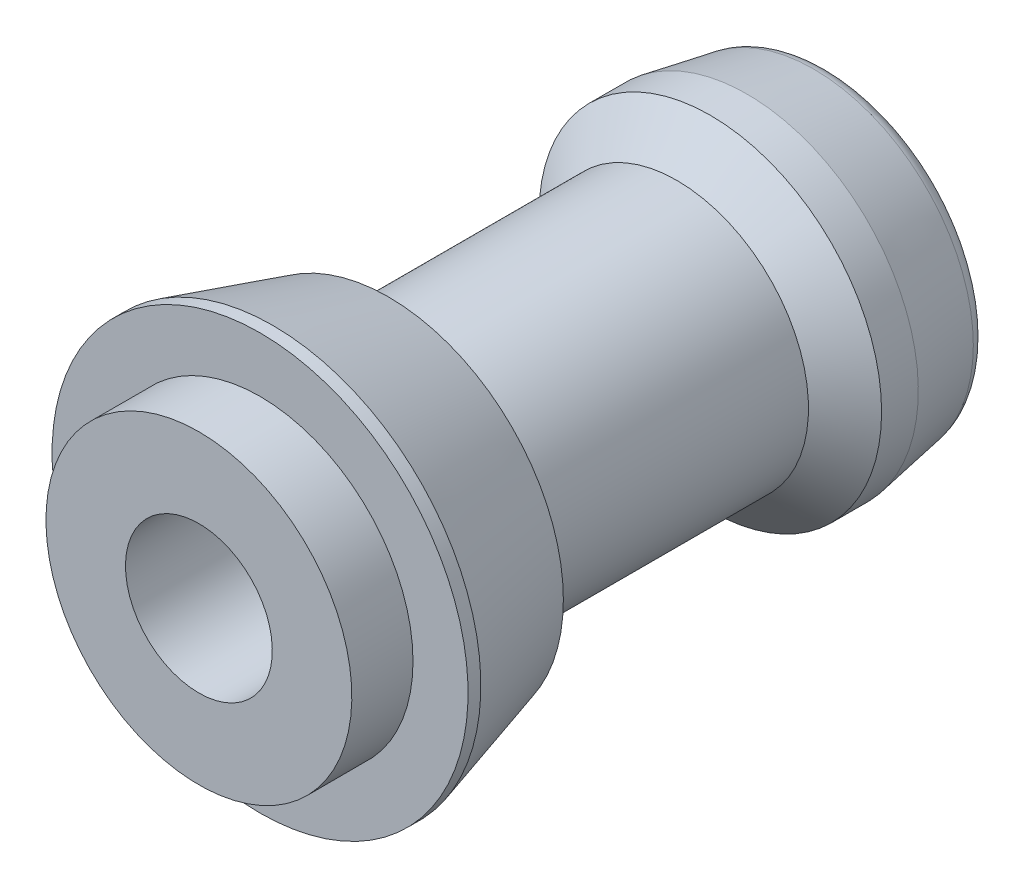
ISO-10303-21;
HEADER;
FILE_DESCRIPTION(('STEP AP214'),'2;1');
FILE_NAME('part.step','',(''),(''),'','','');
FILE_SCHEMA(('AUTOMOTIVE_DESIGN { 1 0 10303 214 1 1 1 1 }'));
ENDSEC;
DATA;
#1=APPLICATION_CONTEXT('core data for automotive mechanical design processes');
#2=APPLICATION_PROTOCOL_DEFINITION('international standard','automotive_design',2000,#1);
#3=PRODUCT_CONTEXT('',#1,'mechanical');
#4=PRODUCT('Part','Part','',(#3));
#5=PRODUCT_RELATED_PRODUCT_CATEGORY('part','',(#4));
#6=PRODUCT_DEFINITION_FORMATION('','',#4);
#7=PRODUCT_DEFINITION_CONTEXT('part definition',#1,'design');
#8=PRODUCT_DEFINITION('design','',#6,#7);
#9=PRODUCT_DEFINITION_SHAPE('','',#8);
#10=(LENGTH_UNIT() NAMED_UNIT(*) SI_UNIT(.MILLI.,.METRE.));
#11=(NAMED_UNIT(*) PLANE_ANGLE_UNIT() SI_UNIT($,.RADIAN.));
#12=(NAMED_UNIT(*) SI_UNIT($,.STERADIAN.) SOLID_ANGLE_UNIT());
#13=UNCERTAINTY_MEASURE_WITH_UNIT(LENGTH_MEASURE(1.E-05),#10,'distance_accuracy_value','');
#14=(GEOMETRIC_REPRESENTATION_CONTEXT(3) GLOBAL_UNCERTAINTY_ASSIGNED_CONTEXT((#13)) GLOBAL_UNIT_ASSIGNED_CONTEXT((#10,
#11,#12)) REPRESENTATION_CONTEXT('',''));
#15=CARTESIAN_POINT('',(0.,0.,0.));
#16=DIRECTION('',(0.,0.,1.));
#17=DIRECTION('',(1.,0.,0.));
#18=AXIS2_PLACEMENT_3D('',#15,#16,#17);
#19=CARTESIAN_POINT('',(0.,0.,5.));
#20=DIRECTION('',(0.,0.,1.));
#21=DIRECTION('',(0.,-1.,0.));
#22=AXIS2_PLACEMENT_3D('',#19,#20,#21);
#23=CYLINDRICAL_SURFACE('',#22,4.924473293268);
#24=CARTESIAN_POINT('',(0.,0.,-19.));
#25=DIRECTION('',(0.,0.,1.));
#26=DIRECTION('',(0.,-1.,0.));
#27=AXIS2_PLACEMENT_3D('',#24,#25,#26);
#28=CIRCLE('',#27,4.924473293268);
#29=CARTESIAN_POINT('',(0.,-4.92447329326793,-19.));
#30=VERTEX_POINT('',#29);
#31=EDGE_CURVE('E139',#30,#30,#28,.T.);
#32=ORIENTED_EDGE('',*,*,#31,.T.);
#33=EDGE_LOOP('',(#32));
#34=FACE_BOUND('',#33,.T.);
#35=CARTESIAN_POINT('',(0.,1.15218884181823E-13,-33.));
#36=DIRECTION('',(0.,0.,-1.));
#37=DIRECTION('',(0.,1.,0.));
#38=AXIS2_PLACEMENT_3D('',#35,#36,#37);
#39=CIRCLE('',#38,4.924473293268);
#40=CARTESIAN_POINT('',(0.,4.92447329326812,-33.));
#41=VERTEX_POINT('',#40);
#42=EDGE_CURVE('E121',#41,#41,#39,.F.);
#43=ORIENTED_EDGE('',*,*,#42,.F.);
#44=EDGE_LOOP('',(#43));
#45=FACE_BOUND('',#44,.T.);
#46=ADVANCED_FACE('F16',(#34,#45),#23,.F.);
#47=CARTESIAN_POINT('',(0.,0.,0.));
#48=DIRECTION('',(0.,0.,1.));
#49=DIRECTION('',(0.,-1.,0.));
#50=AXIS2_PLACEMENT_3D('',#47,#48,#49);
#51=PLANE('',#50);
#52=CARTESIAN_POINT('',(0.,0.,0.));
#53=DIRECTION('',(0.,0.,1.));
#54=DIRECTION('',(0.,-1.,0.));
#55=AXIS2_PLACEMENT_3D('',#52,#53,#54);
#56=CIRCLE('',#55,12.5);
#57=CARTESIAN_POINT('',(0.,-12.5,0.));
#58=VERTEX_POINT('',#57);
#59=EDGE_CURVE('E158',#58,#58,#56,.T.);
#60=ORIENTED_EDGE('',*,*,#59,.F.);
#61=EDGE_LOOP('',(#60));
#62=FACE_BOUND('',#61,.T.);
#63=CARTESIAN_POINT('',(0.,0.,0.));
#64=DIRECTION('',(0.,0.,-1.));
#65=DIRECTION('',(0.,1.,0.));
#66=AXIS2_PLACEMENT_3D('',#63,#64,#65);
#67=CIRCLE('',#66,17.);
#68=CARTESIAN_POINT('',(0.,17.,0.));
#69=VERTEX_POINT('',#68);
#70=EDGE_CURVE('E154',#69,#69,#67,.T.);
#71=ORIENTED_EDGE('',*,*,#70,.F.);
#72=EDGE_LOOP('',(#71));
#73=FACE_BOUND('',#72,.T.);
#74=ADVANCED_FACE('F190',(#62,#73),#51,.T.);
#75=CARTESIAN_POINT('',(0.,0.,0.));
#76=DIRECTION('',(0.,0.,-1.));
#77=DIRECTION('',(0.,1.,0.));
#78=AXIS2_PLACEMENT_3D('',#75,#76,#77);
#79=CYLINDRICAL_SURFACE('',#78,17.);
#80=ORIENTED_EDGE('',*,*,#70,.T.);
#81=EDGE_LOOP('',(#80));
#82=FACE_BOUND('',#81,.T.);
#83=CARTESIAN_POINT('',(0.,0.,-1.04622433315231));
#84=DIRECTION('',(0.,0.,-1.));
#85=DIRECTION('',(0.,1.,0.));
#86=AXIS2_PLACEMENT_3D('',#83,#84,#85);
#87=CIRCLE('',#86,17.);
#88=CARTESIAN_POINT('',(0.,17.,-1.04622433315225));
#89=VERTEX_POINT('',#88);
#90=EDGE_CURVE('E151',#89,#89,#87,.T.);
#91=ORIENTED_EDGE('',*,*,#90,.F.);
#92=EDGE_LOOP('',(#91));
#93=FACE_BOUND('',#92,.T.);
#94=ADVANCED_FACE('F197',(#82,#93),#79,.T.);
#95=CARTESIAN_POINT('',(0.,0.,-10.5));
#96=DIRECTION('',(0.,0.,1.));
#97=DIRECTION('',(0.,-1.,0.));
#98=AXIS2_PLACEMENT_3D('',#95,#96,#97);
#99=CONICAL_SURFACE('',#98,14.2891734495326,0.279252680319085);
#100=ORIENTED_EDGE('',*,*,#90,.T.);
#101=EDGE_LOOP('',(#100));
#102=FACE_BOUND('',#101,.T.);
#103=CARTESIAN_POINT('',(0.,0.,-10.5));
#104=DIRECTION('',(0.,0.,-1.));
#105=DIRECTION('',(0.,1.,0.));
#106=AXIS2_PLACEMENT_3D('',#103,#104,#105);
#107=CIRCLE('',#106,14.2891734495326);
#108=CARTESIAN_POINT('',(0.,14.2891734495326,-10.5));
#109=VERTEX_POINT('',#108);
#110=EDGE_CURVE('E148',#109,#109,#107,.T.);
#111=ORIENTED_EDGE('',*,*,#110,.F.);
#112=EDGE_LOOP('',(#111));
#113=FACE_BOUND('',#112,.T.);
#114=ADVANCED_FACE('F257',(#102,#113),#99,.T.);
#115=CARTESIAN_POINT('',(0.,0.,-12.5433427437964));
#116=DIRECTION('',(0.,0.,1.));
#117=DIRECTION('',(0.,-1.,0.));
#118=AXIS2_PLACEMENT_3D('',#115,#116,#117);
#119=CONICAL_SURFACE('',#118,10.75,1.0471975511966);
#120=CARTESIAN_POINT('',(0.,0.,-12.5433427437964));
#121=DIRECTION('',(0.,0.,1.));
#122=DIRECTION('',(0.,-1.,0.));
#123=AXIS2_PLACEMENT_3D('',#120,#121,#122);
#124=CIRCLE('',#123,10.75);
#125=CARTESIAN_POINT('',(0.,-10.75,-12.5433427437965));
#126=VERTEX_POINT('',#125);
#127=EDGE_CURVE('E20',#126,#126,#124,.T.);
#128=ORIENTED_EDGE('',*,*,#127,.T.);
#129=EDGE_LOOP('',(#128));
#130=FACE_BOUND('',#129,.T.);
#131=ORIENTED_EDGE('',*,*,#110,.T.);
#132=EDGE_LOOP('',(#131));
#133=FACE_BOUND('',#132,.T.);
#134=ADVANCED_FACE('F186',(#130,#133),#119,.T.);
#135=CARTESIAN_POINT('',(0.,0.,0.));
#136=DIRECTION('',(0.,0.,1.));
#137=DIRECTION('',(0.,-1.,0.));
#138=AXIS2_PLACEMENT_3D('',#135,#136,#137);
#139=CYLINDRICAL_SURFACE('',#138,10.75);
#140=ORIENTED_EDGE('',*,*,#127,.F.);
#141=EDGE_LOOP('',(#140));
#142=FACE_BOUND('',#141,.T.);
#143=CARTESIAN_POINT('',(0.,1.18964985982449E-13,-34.0729261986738));
#144=DIRECTION('',(0.,0.,-1.));
#145=DIRECTION('',(0.,1.,0.));
#146=AXIS2_PLACEMENT_3D('',#143,#144,#145);
#147=CIRCLE('',#146,10.75);
#148=CARTESIAN_POINT('',(0.,10.7500000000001,-34.0729261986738));
#149=VERTEX_POINT('',#148);
#150=EDGE_CURVE('E157',#149,#149,#147,.F.);
#151=ORIENTED_EDGE('',*,*,#150,.T.);
#152=EDGE_LOOP('',(#151));
#153=FACE_BOUND('',#152,.T.);
#154=ADVANCED_FACE('F170',(#142,#153),#139,.T.);
#155=CARTESIAN_POINT('',(0.,1.28486513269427E-13,-36.8));
#156=DIRECTION('',(0.,0.,-1.));
#157=DIRECTION('',(0.,1.,0.));
#158=AXIS2_PLACEMENT_3D('',#155,#156,#157);
#159=CONICAL_SURFACE('',#158,14.,0.872664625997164);
#160=CARTESIAN_POINT('',(0.,1.28486513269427E-13,-36.8));
#161=DIRECTION('',(0.,0.,-1.));
#162=DIRECTION('',(0.,1.,0.));
#163=AXIS2_PLACEMENT_3D('',#160,#161,#162);
#164=CIRCLE('',#163,14.);
#165=CARTESIAN_POINT('',(0.,14.0000000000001,-36.7999999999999));
#166=VERTEX_POINT('',#165);
#167=EDGE_CURVE('E165',#166,#166,#164,.F.);
#168=ORIENTED_EDGE('',*,*,#167,.T.);
#169=EDGE_LOOP('',(#168));
#170=FACE_BOUND('',#169,.T.);
#171=ORIENTED_EDGE('',*,*,#150,.F.);
#172=EDGE_LOOP('',(#171));
#173=FACE_BOUND('',#172,.T.);
#174=ADVANCED_FACE('F172',(#170,#173),#159,.T.);
#175=CARTESIAN_POINT('',(0.,0.,0.));
#176=DIRECTION('',(0.,0.,1.));
#177=DIRECTION('',(0.,-1.,0.));
#178=AXIS2_PLACEMENT_3D('',#175,#176,#177);
#179=CYLINDRICAL_SURFACE('',#178,14.);
#180=ORIENTED_EDGE('',*,*,#167,.F.);
#181=EDGE_LOOP('',(#180));
#182=FACE_BOUND('',#181,.T.);
#183=CARTESIAN_POINT('',(0.,1.38960957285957E-13,-39.8));
#184=DIRECTION('',(0.,0.,1.));
#185=DIRECTION('',(0.,-1.,0.));
#186=AXIS2_PLACEMENT_3D('',#183,#184,#185);
#187=CIRCLE('',#186,14.);
#188=CARTESIAN_POINT('',(0.,-13.9999999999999,-39.8000000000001));
#189=VERTEX_POINT('',#188);
#190=EDGE_CURVE('E145',#189,#189,#187,.T.);
#191=ORIENTED_EDGE('',*,*,#190,.T.);
#192=EDGE_LOOP('',(#191));
#193=FACE_BOUND('',#192,.T.);
#194=ADVANCED_FACE('F174',(#182,#193),#179,.T.);
#195=CARTESIAN_POINT('',(0.,1.62353882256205E-13,-46.5));
#196=DIRECTION('',(0.,0.,1.));
#197=DIRECTION('',(0.,-1.,0.));
#198=AXIS2_PLACEMENT_3D('',#195,#196,#197);
#199=CONICAL_SURFACE('',#198,12.8186092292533,0.174532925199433);
#200=CARTESIAN_POINT('',(0.,1.58026094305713E-13,-45.2604722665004));
#201=DIRECTION('',(0.,0.,-1.));
#202=DIRECTION('',(0.,1.,0.));
#203=AXIS2_PLACEMENT_3D('',#200,#201,#202);
#204=CIRCLE('',#203,13.0371714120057);
#205=CARTESIAN_POINT('',(0.,13.0371714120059,-45.2604722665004));
#206=VERTEX_POINT('',#205);
#207=EDGE_CURVE('E25',#206,#206,#204,.F.);
#208=ORIENTED_EDGE('',*,*,#207,.T.);
#209=EDGE_LOOP('',(#208));
#210=FACE_BOUND('',#209,.T.);
#211=ORIENTED_EDGE('',*,*,#190,.F.);
#212=EDGE_LOOP('',(#211));
#213=FACE_BOUND('',#212,.T.);
#214=ADVANCED_FACE('F183',(#210,#213),#199,.T.);
#215=CARTESIAN_POINT('',(12.8186092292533,1.62353882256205E-13,-46.5));
#216=DIRECTION('',(0.,0.,1.));
#217=DIRECTION('',(0.,-1.,0.));
#218=AXIS2_PLACEMENT_3D('',#215,#216,#217);
#219=PLANE('',#218);
#220=CARTESIAN_POINT('',(0.,1.62353882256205E-13,-46.5));
#221=DIRECTION('',(0.,0.,1.));
#222=DIRECTION('',(0.,-1.,0.));
#223=AXIS2_PLACEMENT_3D('',#220,#221,#222);
#224=CIRCLE('',#223,8.25);
#225=CARTESIAN_POINT('',(0.,-8.24999999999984,-46.5));
#226=VERTEX_POINT('',#225);
#227=EDGE_CURVE('E127',#226,#226,#224,.T.);
#228=ORIENTED_EDGE('',*,*,#227,.T.);
#229=EDGE_LOOP('',(#228));
#230=FACE_BOUND('',#229,.T.);
#231=CARTESIAN_POINT('',(0.,1.62353882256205E-13,-46.5));
#232=DIRECTION('',(0.,0.,1.));
#233=DIRECTION('',(0.,-1.,0.));
#234=AXIS2_PLACEMENT_3D('',#231,#232,#233);
#235=CIRCLE('',#234,11.5599597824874);
#236=CARTESIAN_POINT('',(0.,-11.5599597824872,-46.5));
#237=VERTEX_POINT('',#236);
#238=EDGE_CURVE('E10',#237,#237,#235,.F.);
#239=ORIENTED_EDGE('',*,*,#238,.T.);
#240=EDGE_LOOP('',(#239));
#241=FACE_BOUND('',#240,.T.);
#242=ADVANCED_FACE('F211',(#230,#241),#219,.F.);
#243=CARTESIAN_POINT('',(0.,0.,5.));
#244=DIRECTION('',(0.,0.,1.));
#245=DIRECTION('',(0.,-1.,0.));
#246=AXIS2_PLACEMENT_3D('',#243,#244,#245);
#247=PLANE('',#246);
#248=CARTESIAN_POINT('',(0.,0.,5.));
#249=DIRECTION('',(0.,0.,1.));
#250=DIRECTION('',(0.,-1.,0.));
#251=AXIS2_PLACEMENT_3D('',#248,#249,#250);
#252=CIRCLE('',#251,6.);
#253=CARTESIAN_POINT('',(0.,-6.00000000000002,4.99999999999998));
#254=VERTEX_POINT('',#253);
#255=EDGE_CURVE('E133',#254,#254,#252,.T.);
#256=ORIENTED_EDGE('',*,*,#255,.F.);
#257=EDGE_LOOP('',(#256));
#258=FACE_BOUND('',#257,.T.);
#259=CARTESIAN_POINT('',(0.,0.,5.));
#260=DIRECTION('',(0.,0.,-1.));
#261=DIRECTION('',(0.,1.,0.));
#262=AXIS2_PLACEMENT_3D('',#259,#260,#261);
#263=CIRCLE('',#262,12.5);
#264=CARTESIAN_POINT('',(0.,12.5,5.00000000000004));
#265=VERTEX_POINT('',#264);
#266=EDGE_CURVE('E142',#265,#265,#263,.T.);
#267=ORIENTED_EDGE('',*,*,#266,.F.);
#268=EDGE_LOOP('',(#267));
#269=FACE_BOUND('',#268,.T.);
#270=ADVANCED_FACE('F207',(#258,#269),#247,.T.);
#271=CARTESIAN_POINT('',(0.,0.,0.));
#272=DIRECTION('',(0.,0.,-1.));
#273=DIRECTION('',(0.,1.,0.));
#274=AXIS2_PLACEMENT_3D('',#271,#272,#273);
#275=CYLINDRICAL_SURFACE('',#274,12.5);
#276=ORIENTED_EDGE('',*,*,#266,.T.);
#277=EDGE_LOOP('',(#276));
#278=FACE_BOUND('',#277,.T.);
#279=ORIENTED_EDGE('',*,*,#59,.T.);
#280=EDGE_LOOP('',(#279));
#281=FACE_BOUND('',#280,.T.);
#282=ADVANCED_FACE('F204',(#278,#281),#275,.T.);
#283=CARTESIAN_POINT('',(0.,1.57116660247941E-13,-45.));
#284=DIRECTION('',(0.,0.,1.));
#285=DIRECTION('',(0.,-1.,0.));
#286=AXIS2_PLACEMENT_3D('',#283,#284,#285);
#287=TOROIDAL_SURFACE('',#286,11.5599597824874,1.5);
#288=ORIENTED_EDGE('',*,*,#238,.F.);
#289=EDGE_LOOP('',(#288));
#290=FACE_BOUND('',#289,.T.);
#291=ORIENTED_EDGE('',*,*,#207,.F.);
#292=EDGE_LOOP('',(#291));
#293=FACE_BOUND('',#292,.T.);
#294=ADVANCED_FACE('F18',(#290,#293),#287,.T.);
#295=CARTESIAN_POINT('',(6.,0.,-19.));
#296=DIRECTION('',(0.,0.,-1.));
#297=DIRECTION('',(0.,1.,0.));
#298=AXIS2_PLACEMENT_3D('',#295,#296,#297);
#299=PLANE('',#298);
#300=ORIENTED_EDGE('',*,*,#31,.F.);
#301=EDGE_LOOP('',(#300));
#302=FACE_BOUND('',#301,.T.);
#303=CARTESIAN_POINT('',(0.,0.,-19.));
#304=DIRECTION('',(0.,0.,1.));
#305=DIRECTION('',(0.,-1.,0.));
#306=AXIS2_PLACEMENT_3D('',#303,#304,#305);
#307=CIRCLE('',#306,6.);
#308=CARTESIAN_POINT('',(0.,-5.99999999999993,-19.));
#309=VERTEX_POINT('',#308);
#310=EDGE_CURVE('E136',#309,#309,#307,.T.);
#311=ORIENTED_EDGE('',*,*,#310,.T.);
#312=EDGE_LOOP('',(#311));
#313=FACE_BOUND('',#312,.T.);
#314=ADVANCED_FACE('F202',(#302,#313),#299,.F.);
#315=CARTESIAN_POINT('',(0.,0.,5.));
#316=DIRECTION('',(0.,0.,1.));
#317=DIRECTION('',(0.,-1.,0.));
#318=AXIS2_PLACEMENT_3D('',#315,#316,#317);
#319=CYLINDRICAL_SURFACE('',#318,6.);
#320=ORIENTED_EDGE('',*,*,#310,.F.);
#321=EDGE_LOOP('',(#320));
#322=FACE_BOUND('',#321,.T.);
#323=ORIENTED_EDGE('',*,*,#255,.T.);
#324=EDGE_LOOP('',(#323));
#325=FACE_BOUND('',#324,.T.);
#326=ADVANCED_FACE('F232',(#322,#325),#319,.F.);
#327=CARTESIAN_POINT('',(8.25,1.39659253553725E-13,-40.));
#328=DIRECTION('',(0.,0.,-1.));
#329=DIRECTION('',(0.,1.,0.));
#330=AXIS2_PLACEMENT_3D('',#327,#328,#329);
#331=PLANE('',#330);
#332=DIRECTION('',(0.5,-0.866025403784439,0.));
#333=VECTOR('',#332,1.);
#334=CARTESIAN_POINT('',(2.88675134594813,5.00000000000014,-40.));
#335=LINE('',#334,#333);
#336=CARTESIAN_POINT('',(2.88675134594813,5.00000000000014,-40.));
#337=VERTEX_POINT('',#336);
#338=CARTESIAN_POINT('',(5.77350269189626,1.42478179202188E-13,-40.));
#339=VERTEX_POINT('',#338);
#340=EDGE_CURVE('E33',#337,#339,#335,.T.);
#341=ORIENTED_EDGE('',*,*,#340,.F.);
#342=DIRECTION('',(1.,0.,0.));
#343=VECTOR('',#342,1.);
#344=CARTESIAN_POINT('',(-2.88675134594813,5.00000000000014,-40.));
#345=LINE('',#344,#343);
#346=CARTESIAN_POINT('',(-2.88675134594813,5.00000000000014,-40.));
#347=VERTEX_POINT('',#346);
#348=EDGE_CURVE('E117',#347,#337,#345,.T.);
#349=ORIENTED_EDGE('',*,*,#348,.F.);
#350=DIRECTION('',(0.5,0.866025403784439,0.));
#351=VECTOR('',#350,1.);
#352=CARTESIAN_POINT('',(-5.77350269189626,1.38805213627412E-13,-40.));
#353=LINE('',#352,#351);
#354=CARTESIAN_POINT('',(-5.77350269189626,1.38805213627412E-13,-40.));
#355=VERTEX_POINT('',#354);
#356=EDGE_CURVE('E115',#355,#347,#353,.T.);
#357=ORIENTED_EDGE('',*,*,#356,.F.);
#358=DIRECTION('',(-0.5,0.866025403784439,0.));
#359=VECTOR('',#358,1.);
#360=CARTESIAN_POINT('',(-2.88675134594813,-4.99999999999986,-40.));
#361=LINE('',#360,#359);
#362=CARTESIAN_POINT('',(-2.88675134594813,-4.99999999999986,-40.));
#363=VERTEX_POINT('',#362);
#364=EDGE_CURVE('E81',#363,#355,#361,.T.);
#365=ORIENTED_EDGE('',*,*,#364,.F.);
#366=DIRECTION('',(-1.,0.,0.));
#367=VECTOR('',#366,1.);
#368=CARTESIAN_POINT('',(2.88675134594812,-4.99999999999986,-40.));
#369=LINE('',#368,#367);
#370=CARTESIAN_POINT('',(2.88675134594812,-4.99999999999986,-40.));
#371=VERTEX_POINT('',#370);
#372=EDGE_CURVE('E111',#371,#363,#369,.T.);
#373=ORIENTED_EDGE('',*,*,#372,.F.);
#374=DIRECTION('',(-0.5,-0.866025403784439,0.));
#375=VECTOR('',#374,1.);
#376=CARTESIAN_POINT('',(5.77350269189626,1.42356811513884E-13,-40.));
#377=LINE('',#376,#375);
#378=EDGE_CURVE('E108',#339,#371,#377,.T.);
#379=ORIENTED_EDGE('',*,*,#378,.F.);
#380=EDGE_LOOP('',(#341,#349,#357,#365,#373,#379));
#381=FACE_BOUND('',#380,.T.);
#382=CARTESIAN_POINT('',(0.,1.39659253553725E-13,-40.));
#383=DIRECTION('',(0.,0.,1.));
#384=DIRECTION('',(0.,-1.,0.));
#385=AXIS2_PLACEMENT_3D('',#382,#383,#384);
#386=CIRCLE('',#385,8.25);
#387=CARTESIAN_POINT('',(0.,-8.24999999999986,-40.));
#388=VERTEX_POINT('',#387);
#389=EDGE_CURVE('E130',#388,#388,#386,.T.);
#390=ORIENTED_EDGE('',*,*,#389,.F.);
#391=EDGE_LOOP('',(#390));
#392=FACE_BOUND('',#391,.T.);
#393=ADVANCED_FACE('F241',(#381,#392),#331,.T.);
#394=CARTESIAN_POINT('',(0.,0.,0.));
#395=DIRECTION('',(0.,0.,1.));
#396=DIRECTION('',(0.,-1.,0.));
#397=AXIS2_PLACEMENT_3D('',#394,#395,#396);
#398=CYLINDRICAL_SURFACE('',#397,8.25);
#399=ORIENTED_EDGE('',*,*,#389,.T.);
#400=EDGE_LOOP('',(#399));
#401=FACE_BOUND('',#400,.T.);
#402=ORIENTED_EDGE('',*,*,#227,.F.);
#403=EDGE_LOOP('',(#402));
#404=FACE_BOUND('',#403,.T.);
#405=ADVANCED_FACE('F357',(#401,#404),#398,.F.);
#406=CARTESIAN_POINT('',(0.,1.15218884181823E-13,-33.));
#407=DIRECTION('',(0.,0.,-1.));
#408=DIRECTION('',(0.,1.,0.));
#409=AXIS2_PLACEMENT_3D('',#406,#407,#408);
#410=PLANE('',#409);
#411=DIRECTION('',(0.5,-0.866025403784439,0.));
#412=VECTOR('',#411,1.);
#413=CARTESIAN_POINT('',(2.88675134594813,5.00000000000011,-33.));
#414=LINE('',#413,#412);
#415=CARTESIAN_POINT('',(2.88675134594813,5.00000000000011,-33.));
#416=VERTEX_POINT('',#415);
#417=CARTESIAN_POINT('',(5.77350269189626,1.17916442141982E-13,-33.));
#418=VERTEX_POINT('',#417);
#419=EDGE_CURVE('E119',#416,#418,#414,.T.);
#420=ORIENTED_EDGE('',*,*,#419,.T.);
#421=DIRECTION('',(-0.5,-0.866025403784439,0.));
#422=VECTOR('',#421,1.);
#423=CARTESIAN_POINT('',(5.77350269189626,1.17916442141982E-13,-33.));
#424=LINE('',#423,#422);
#425=CARTESIAN_POINT('',(2.88675134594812,-4.99999999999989,-33.));
#426=VERTEX_POINT('',#425);
#427=EDGE_CURVE('E102',#418,#426,#424,.T.);
#428=ORIENTED_EDGE('',*,*,#427,.T.);
#429=DIRECTION('',(-1.,0.,0.));
#430=VECTOR('',#429,1.);
#431=CARTESIAN_POINT('',(2.88675134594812,-4.99999999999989,-33.));
#432=LINE('',#431,#430);
#433=CARTESIAN_POINT('',(-2.88675134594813,-4.99999999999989,-33.));
#434=VERTEX_POINT('',#433);
#435=EDGE_CURVE('E100',#426,#434,#432,.T.);
#436=ORIENTED_EDGE('',*,*,#435,.T.);
#437=DIRECTION('',(-0.5,0.866025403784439,0.));
#438=VECTOR('',#437,1.);
#439=CARTESIAN_POINT('',(-2.88675134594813,-4.99999999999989,-33.));
#440=LINE('',#439,#438);
#441=CARTESIAN_POINT('',(-5.77350269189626,1.1436484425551E-13,-33.));
#442=VERTEX_POINT('',#441);
#443=EDGE_CURVE('E78',#434,#442,#440,.T.);
#444=ORIENTED_EDGE('',*,*,#443,.T.);
#445=DIRECTION('',(0.5,0.866025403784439,0.));
#446=VECTOR('',#445,1.);
#447=CARTESIAN_POINT('',(-5.77350269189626,1.1436484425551E-13,-33.));
#448=LINE('',#447,#446);
#449=CARTESIAN_POINT('',(-2.88675134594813,5.00000000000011,-33.));
#450=VERTEX_POINT('',#449);
#451=EDGE_CURVE('E89',#442,#450,#448,.T.);
#452=ORIENTED_EDGE('',*,*,#451,.T.);
#453=DIRECTION('',(1.,0.,0.));
#454=VECTOR('',#453,1.);
#455=CARTESIAN_POINT('',(-2.88675134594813,5.00000000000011,-33.));
#456=LINE('',#455,#454);
#457=EDGE_CURVE('E93',#450,#416,#456,.T.);
#458=ORIENTED_EDGE('',*,*,#457,.T.);
#459=EDGE_LOOP('',(#420,#428,#436,#444,#452,#458));
#460=FACE_BOUND('',#459,.T.);
#461=ORIENTED_EDGE('',*,*,#42,.T.);
#462=EDGE_LOOP('',(#461));
#463=FACE_BOUND('',#462,.T.);
#464=ADVANCED_FACE('F96',(#460,#463),#410,.T.);
#465=CARTESIAN_POINT('',(2.88675134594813,5.00000000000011,-33.));
#466=DIRECTION('',(0.866025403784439,0.5,0.));
#467=DIRECTION('',(-0.5,0.866025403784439,0.));
#468=AXIS2_PLACEMENT_3D('',#465,#466,#467);
#469=PLANE('',#468);
#470=ORIENTED_EDGE('',*,*,#340,.T.);
#471=DIRECTION('',(0.,0.,-1.));
#472=VECTOR('',#471,1.);
#473=CARTESIAN_POINT('',(5.77350269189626,1.17916442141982E-13,-33.));
#474=LINE('',#473,#472);
#475=EDGE_CURVE('E63',#418,#339,#474,.T.);
#476=ORIENTED_EDGE('',*,*,#475,.F.);
#477=ORIENTED_EDGE('',*,*,#419,.F.);
#478=DIRECTION('',(0.,0.,-1.));
#479=VECTOR('',#478,1.);
#480=CARTESIAN_POINT('',(2.88675134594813,5.00000000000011,-33.));
#481=LINE('',#480,#479);
#482=EDGE_CURVE('E41',#416,#337,#481,.T.);
#483=ORIENTED_EDGE('',*,*,#482,.T.);
#484=EDGE_LOOP('',(#470,#476,#477,#483));
#485=FACE_BOUND('',#484,.T.);
#486=ADVANCED_FACE('F373',(#485),#469,.F.);
#487=CARTESIAN_POINT('',(-2.88675134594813,5.00000000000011,-33.));
#488=DIRECTION('',(0.,1.,0.));
#489=DIRECTION('',(-1.,0.,0.));
#490=AXIS2_PLACEMENT_3D('',#487,#488,#489);
#491=PLANE('',#490);
#492=ORIENTED_EDGE('',*,*,#348,.T.);
#493=ORIENTED_EDGE('',*,*,#482,.F.);
#494=ORIENTED_EDGE('',*,*,#457,.F.);
#495=DIRECTION('',(0.,0.,-1.));
#496=VECTOR('',#495,1.);
#497=CARTESIAN_POINT('',(-2.88675134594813,5.00000000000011,-33.));
#498=LINE('',#497,#496);
#499=EDGE_CURVE('E85',#450,#347,#498,.T.);
#500=ORIENTED_EDGE('',*,*,#499,.T.);
#501=EDGE_LOOP('',(#492,#493,#494,#500));
#502=FACE_BOUND('',#501,.T.);
#503=ADVANCED_FACE('F381',(#502),#491,.F.);
#504=CARTESIAN_POINT('',(-5.77350269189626,1.1436484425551E-13,-33.));
#505=DIRECTION('',(-0.866025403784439,0.5,0.));
#506=DIRECTION('',(-0.5,-0.866025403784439,0.));
#507=AXIS2_PLACEMENT_3D('',#504,#505,#506);
#508=PLANE('',#507);
#509=ORIENTED_EDGE('',*,*,#356,.T.);
#510=ORIENTED_EDGE('',*,*,#499,.F.);
#511=ORIENTED_EDGE('',*,*,#451,.F.);
#512=DIRECTION('',(0.,0.,-1.));
#513=VECTOR('',#512,1.);
#514=CARTESIAN_POINT('',(-5.77350269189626,1.1436484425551E-13,-33.));
#515=LINE('',#514,#513);
#516=EDGE_CURVE('E74',#442,#355,#515,.T.);
#517=ORIENTED_EDGE('',*,*,#516,.T.);
#518=EDGE_LOOP('',(#509,#510,#511,#517));
#519=FACE_BOUND('',#518,.T.);
#520=ADVANCED_FACE('F90',(#519),#508,.F.);
#521=CARTESIAN_POINT('',(-2.88675134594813,-4.99999999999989,-33.));
#522=DIRECTION('',(-0.866025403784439,-0.5,0.));
#523=DIRECTION('',(0.5,-0.866025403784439,0.));
#524=AXIS2_PLACEMENT_3D('',#521,#522,#523);
#525=PLANE('',#524);
#526=ORIENTED_EDGE('',*,*,#364,.T.);
#527=ORIENTED_EDGE('',*,*,#516,.F.);
#528=ORIENTED_EDGE('',*,*,#443,.F.);
#529=DIRECTION('',(0.,0.,-1.));
#530=VECTOR('',#529,1.);
#531=CARTESIAN_POINT('',(-2.88675134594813,-4.99999999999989,-33.));
#532=LINE('',#531,#530);
#533=EDGE_CURVE('E86',#434,#363,#532,.T.);
#534=ORIENTED_EDGE('',*,*,#533,.T.);
#535=EDGE_LOOP('',(#526,#527,#528,#534));
#536=FACE_BOUND('',#535,.T.);
#537=ADVANCED_FACE('F76',(#536),#525,.F.);
#538=CARTESIAN_POINT('',(2.88675134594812,-4.99999999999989,-33.));
#539=DIRECTION('',(0.,-1.,0.));
#540=DIRECTION('',(1.,0.,0.));
#541=AXIS2_PLACEMENT_3D('',#538,#539,#540);
#542=PLANE('',#541);
#543=ORIENTED_EDGE('',*,*,#372,.T.);
#544=ORIENTED_EDGE('',*,*,#533,.F.);
#545=ORIENTED_EDGE('',*,*,#435,.F.);
#546=DIRECTION('',(0.,0.,-1.));
#547=VECTOR('',#546,1.);
#548=CARTESIAN_POINT('',(2.88675134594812,-4.99999999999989,-33.));
#549=LINE('',#548,#547);
#550=EDGE_CURVE('E124',#426,#371,#549,.T.);
#551=ORIENTED_EDGE('',*,*,#550,.T.);
#552=EDGE_LOOP('',(#543,#544,#545,#551));
#553=FACE_BOUND('',#552,.T.);
#554=ADVANCED_FACE('F403',(#553),#542,.F.);
#555=CARTESIAN_POINT('',(5.77350269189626,1.17916442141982E-13,-33.));
#556=DIRECTION('',(0.866025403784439,-0.5,0.));
#557=DIRECTION('',(0.5,0.866025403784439,0.));
#558=AXIS2_PLACEMENT_3D('',#555,#556,#557);
#559=PLANE('',#558);
#560=ORIENTED_EDGE('',*,*,#378,.T.);
#561=ORIENTED_EDGE('',*,*,#550,.F.);
#562=ORIENTED_EDGE('',*,*,#427,.F.);
#563=ORIENTED_EDGE('',*,*,#475,.T.);
#564=EDGE_LOOP('',(#560,#561,#562,#563));
#565=FACE_BOUND('',#564,.T.);
#566=ADVANCED_FACE('F411',(#565),#559,.F.);
#567=CLOSED_SHELL('',(#46,#74,#94,#114,#134,#154,#174,#194,#214,#242,#270,#282,#294,#314,#326,
#393,#405,#464,#486,#503,#520,#537,#554,#566));
#568=MANIFOLD_SOLID_BREP('B1',#567);
#569=ADVANCED_BREP_SHAPE_REPRESENTATION('',(#18,#568),#14);
#570=SHAPE_DEFINITION_REPRESENTATION(#9,#569);
ENDSEC;
END-ISO-10303-21;
